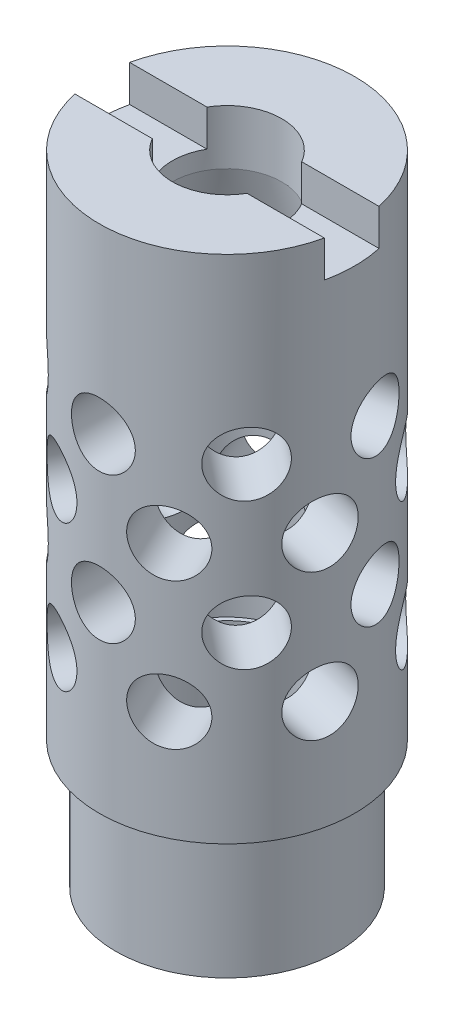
from build123d import *

# Parameters (mm, degrees)
SKETCH5_W                                = 1.389126
SKETCH5_H                                = 5.55625
F_7_64_0_10938_DIAMETER_HOLE1_AT_2_COUNT = 2
F_7_64_0_10938_DIAMETER_HOLE1_AT_2_PITCH = 6.35
SKETCH6_W                                = 11.1125
SKETCH6_H                                = 2.38125
EXTRUDE1_DEPTH                           = 1.5875
SKETCH9_W                                = 1.389126
SKETCH9_H                                = 5.55625
F_7_64_0_10938_DIAMETER_HOLE2_AT_2_COUNT = 2
F_7_64_0_10938_DIAMETER_HOLE2_AT_2_PITCH = 6.35
CIRPATTERN1_COUNT                        = 7
CIRPATTERN1_COPY_1_SKETCH_W              = 1.389126
CIRPATTERN1_COPY_1_SKETCH_H              = 5.55625
CIRPATTERN1_COPY_2_SKETCH_W              = 1.389126
CIRPATTERN1_COPY_2_SKETCH_H              = 5.55625
CIRPATTERN1_COPY_3_SKETCH_W              = 1.389126
CIRPATTERN1_COPY_3_SKETCH_H              = 5.55625
CIRPATTERN1_COPY_4_SKETCH_W              = 1.389126
CIRPATTERN1_COPY_4_SKETCH_H              = 5.55625
CIRPATTERN1_COPY_5_SKETCH_W              = 1.389126
CIRPATTERN1_COPY_5_SKETCH_H              = 5.55625
CIRPATTERN1_COPY_6_SKETCH_W              = 1.389126
CIRPATTERN1_COPY_6_SKETCH_H              = 5.55625
CIRPATTERN1_COPY_7_SKETCH_W              = 1.389126
CIRPATTERN1_COPY_7_SKETCH_H              = 5.55625
CIRPATTERN1_COPY_8_SKETCH_W              = 1.389126
CIRPATTERN1_COPY_8_SKETCH_H              = 5.55625
CIRPATTERN1_COPY_9_SKETCH_W              = 1.389126
CIRPATTERN1_COPY_9_SKETCH_H              = 5.55625
CIRPATTERN1_COPY_10_SKETCH_W             = 1.389126
CIRPATTERN1_COPY_10_SKETCH_H             = 5.55625
CIRPATTERN1_COPY_11_SKETCH_W             = 1.389126
CIRPATTERN1_COPY_11_SKETCH_H             = 5.55625
CIRPATTERN1_COPY_12_SKETCH_W             = 1.389126
CIRPATTERN1_COPY_12_SKETCH_H             = 5.55625


with BuildPart() as part:
    # Sketch1 → Revolve1 (revolve)
    with BuildSketch(Plane.XY, mode=Mode.PRIVATE) as revolve1_sk:
        Polygon((2.38125, 27.78125), (2.38125, 25.4), (3.175, 21.665699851), (3.175, 7.9375), (2.9845, 7.9375), (2.9845, 0), (4.84505, 0), (4.84505, 5.55625), (5.55625, 5.55625), (5.55625, 27.78125), align=None)
    revolve(revolve1_sk.sketch.rotate(Axis((0, 0, 0), (0, 1, 0)), 90), axis=Axis((0, 0, 0), (0, 1, 0)))

    # Sketch5 → 7_64 _0.10938_ Diameter Hole1 (revolve, cut)
    with BuildSketch(Plane(origin=(0, 19.84375, 0), x_dir=(0, 1, 0), z_dir=(1, 0, 0))):
        with Locations((0.694563, 2.778125)):
            Rectangle(SKETCH5_W, SKETCH5_H)
    f_7_64_0_10938_diameter_hole1 = revolve(axis=Axis((0, 19.84375, -6.35), (0, 0, 1)), mode=Mode.SUBTRACT)

    # 7_64 _0.10938_ Diameter Hole1 at 2: 7_64 _0.10938_ Diameter Hole1 ×2
    with Locations(*[(0, -i * F_7_64_0_10938_DIAMETER_HOLE1_AT_2_PITCH, 0) for i in range(1, F_7_64_0_10938_DIAMETER_HOLE1_AT_2_COUNT)]):
        add(f_7_64_0_10938_diameter_hole1, mode=Mode.SUBTRACT)

    # Sketch6 → Extrude1 (cut)
    with BuildSketch(Plane(origin=(0, 27.78125, 0), x_dir=(1, 0, 0), z_dir=(0, 1, 0))):
        Rectangle(SKETCH6_W, SKETCH6_H)
    extrude(amount=-EXTRUDE1_DEPTH, mode=Mode.SUBTRACT)

    # Sketch9 → 7_64 _0.10938_ Diameter Hole2 (revolve, cut)
    with BuildSketch(Plane(origin=(0, 16.66875, 0), x_dir=(0, -1, 0), z_dir=(1, 0, 0))):
        with Locations((0.694563, 2.778125)):
            Rectangle(SKETCH9_W, SKETCH9_H)
    f_7_64_0_10938_diameter_hole2 = revolve(axis=Axis((0, 16.66875, 6.35), (0, 0, -1)), mode=Mode.SUBTRACT)

    # 7_64 _0.10938_ Diameter Hole2 at 2: 7_64 _0.10938_ Diameter Hole2 ×2
    with Locations(*[(0, -i * F_7_64_0_10938_DIAMETER_HOLE2_AT_2_PITCH, 0) for i in range(1, F_7_64_0_10938_DIAMETER_HOLE2_AT_2_COUNT)]):
        add(f_7_64_0_10938_diameter_hole2, mode=Mode.SUBTRACT)

    # CirPattern1: 7_64 _0.10938_ Diameter Hole1, 7_64 _0.10938_ Diameter Hole2 ×7 about axis
    cirpattern1_axis = Axis((0, 25.4, 0), (0, -1, 0))
    add([f_7_64_0_10938_diameter_hole1.rotate(cirpattern1_axis, i * 360 / CIRPATTERN1_COUNT) for i in range(1, CIRPATTERN1_COUNT)], mode=Mode.SUBTRACT)
    add([f_7_64_0_10938_diameter_hole2.rotate(cirpattern1_axis, i * 360 / CIRPATTERN1_COUNT) for i in range(1, CIRPATTERN1_COUNT)], mode=Mode.SUBTRACT)

    # CirPattern1 copy 1 sketch → CirPattern1 copy 1 (revolve, cut)
    with BuildSketch(Plane(origin=(0, 13.49375, 0), x_dir=(0, 1, 0), z_dir=(0.6234898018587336, 0, 0.7818314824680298))):
        with Locations((0.694563, 2.778125)):
            Rectangle(CIRPATTERN1_COPY_1_SKETCH_W, CIRPATTERN1_COPY_1_SKETCH_H)
    revolve(axis=Axis((4.964629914, 13.49375, -3.959160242), (-0.7818314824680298, 0, 0.6234898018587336)), mode=Mode.SUBTRACT)

    # CirPattern1 copy 2 sketch → CirPattern1 copy 2 (revolve, cut)
    with BuildSketch(Plane(origin=(0, 13.49375, 0), x_dir=(0, 1, 0), z_dir=(-0.22252093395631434, 0, 0.9749279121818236))):
        with Locations((0.694563, 2.778125)):
            Rectangle(CIRPATTERN1_COPY_2_SKETCH_W, CIRPATTERN1_COPY_2_SKETCH_H)
    revolve(axis=Axis((6.190792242, 13.49375, 1.413007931), (-0.9749279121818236, 0, -0.22252093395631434)), mode=Mode.SUBTRACT)

    # CirPattern1 copy 3 sketch → CirPattern1 copy 3 (revolve, cut)
    with BuildSketch(Plane(origin=(0, 13.49375, 0), x_dir=(0, 1, 0), z_dir=(-0.900968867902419, 0, 0.43388373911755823))):
        with Locations((0.694563, 2.778125)):
            Rectangle(CIRPATTERN1_COPY_3_SKETCH_W, CIRPATTERN1_COPY_3_SKETCH_H)
    revolve(axis=Axis((2.755161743, 13.49375, 5.721152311), (-0.43388373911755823, 0, -0.900968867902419)), mode=Mode.SUBTRACT)

    # CirPattern1 copy 4 sketch → CirPattern1 copy 4 (revolve, cut)
    with BuildSketch(Plane(origin=(0, 13.49375, 0), x_dir=(0, 1, 0), z_dir=(-0.9009688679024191, 0, -0.433883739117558))):
        with Locations((0.694563, 2.778125)):
            Rectangle(CIRPATTERN1_COPY_4_SKETCH_W, CIRPATTERN1_COPY_4_SKETCH_H)
    revolve(axis=Axis((-2.755161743, 13.49375, 5.721152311), (0.433883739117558, 0, -0.9009688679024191)), mode=Mode.SUBTRACT)

    # CirPattern1 copy 5 sketch → CirPattern1 copy 5 (revolve, cut)
    with BuildSketch(Plane(origin=(0, 13.49375, 0), x_dir=(0, 1, 0), z_dir=(-0.2225209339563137, 0, -0.9749279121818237))):
        with Locations((0.694563, 2.778125)):
            Rectangle(CIRPATTERN1_COPY_5_SKETCH_W, CIRPATTERN1_COPY_5_SKETCH_H)
    revolve(axis=Axis((-6.190792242, 13.49375, 1.413007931), (0.9749279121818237, 0, -0.2225209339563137)), mode=Mode.SUBTRACT)

    # CirPattern1 copy 6 sketch → CirPattern1 copy 6 (revolve, cut)
    with BuildSketch(Plane(origin=(0, 13.49375, 0), x_dir=(0, 1, 0), z_dir=(0.6234898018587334, 0, -0.7818314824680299))):
        with Locations((0.694563, 2.778125)):
            Rectangle(CIRPATTERN1_COPY_6_SKETCH_W, CIRPATTERN1_COPY_6_SKETCH_H)
    revolve(axis=Axis((-4.964629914, 13.49375, -3.959160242), (0.7818314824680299, 0, 0.6234898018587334)), mode=Mode.SUBTRACT)

    # CirPattern1 copy 7 sketch → CirPattern1 copy 7 (revolve, cut)
    with BuildSketch(Plane(origin=(0, 10.31875, 0), x_dir=(0, -1, 0), z_dir=(0.6234898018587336, 0, 0.7818314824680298))):
        with Locations((0.694563, 2.778125)):
            Rectangle(CIRPATTERN1_COPY_7_SKETCH_W, CIRPATTERN1_COPY_7_SKETCH_H)
    revolve(axis=Axis((-4.964629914, 10.31875, 3.959160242), (0.7818314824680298, 0, -0.6234898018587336)), mode=Mode.SUBTRACT)

    # CirPattern1 copy 8 sketch → CirPattern1 copy 8 (revolve, cut)
    with BuildSketch(Plane(origin=(0, 10.31875, 0), x_dir=(0, -1, 0), z_dir=(-0.22252093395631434, 0, 0.9749279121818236))):
        with Locations((0.694563, 2.778125)):
            Rectangle(CIRPATTERN1_COPY_8_SKETCH_W, CIRPATTERN1_COPY_8_SKETCH_H)
    revolve(axis=Axis((-6.190792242, 10.31875, -1.413007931), (0.9749279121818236, 0, 0.22252093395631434)), mode=Mode.SUBTRACT)

    # CirPattern1 copy 9 sketch → CirPattern1 copy 9 (revolve, cut)
    with BuildSketch(Plane(origin=(0, 10.31875, 0), x_dir=(0, -1, 0), z_dir=(-0.900968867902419, 0, 0.43388373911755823))):
        with Locations((0.694563, 2.778125)):
            Rectangle(CIRPATTERN1_COPY_9_SKETCH_W, CIRPATTERN1_COPY_9_SKETCH_H)
    revolve(axis=Axis((-2.755161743, 10.31875, -5.721152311), (0.43388373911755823, 0, 0.900968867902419)), mode=Mode.SUBTRACT)

    # CirPattern1 copy 10 sketch → CirPattern1 copy 10 (revolve, cut)
    with BuildSketch(Plane(origin=(0, 10.31875, 0), x_dir=(0, -1, 0), z_dir=(-0.9009688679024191, 0, -0.433883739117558))):
        with Locations((0.694563, 2.778125)):
            Rectangle(CIRPATTERN1_COPY_10_SKETCH_W, CIRPATTERN1_COPY_10_SKETCH_H)
    revolve(axis=Axis((2.755161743, 10.31875, -5.721152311), (-0.433883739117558, 0, 0.9009688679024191)), mode=Mode.SUBTRACT)

    # CirPattern1 copy 11 sketch → CirPattern1 copy 11 (revolve, cut)
    with BuildSketch(Plane(origin=(0, 10.31875, 0), x_dir=(0, -1, 0), z_dir=(-0.2225209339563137, 0, -0.9749279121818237))):
        with Locations((0.694563, 2.778125)):
            Rectangle(CIRPATTERN1_COPY_11_SKETCH_W, CIRPATTERN1_COPY_11_SKETCH_H)
    revolve(axis=Axis((6.190792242, 10.31875, -1.413007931), (-0.9749279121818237, 0, 0.2225209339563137)), mode=Mode.SUBTRACT)

    # CirPattern1 copy 12 sketch → CirPattern1 copy 12 (revolve, cut)
    with BuildSketch(Plane(origin=(0, 10.31875, 0), x_dir=(0, -1, 0), z_dir=(0.6234898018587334, 0, -0.7818314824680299))):
        with Locations((0.694563, 2.778125)):
            Rectangle(CIRPATTERN1_COPY_12_SKETCH_W, CIRPATTERN1_COPY_12_SKETCH_H)
    revolve(axis=Axis((4.964629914, 10.31875, 3.959160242), (-0.7818314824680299, 0, -0.6234898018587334)), mode=Mode.SUBTRACT)


solid = part.part
